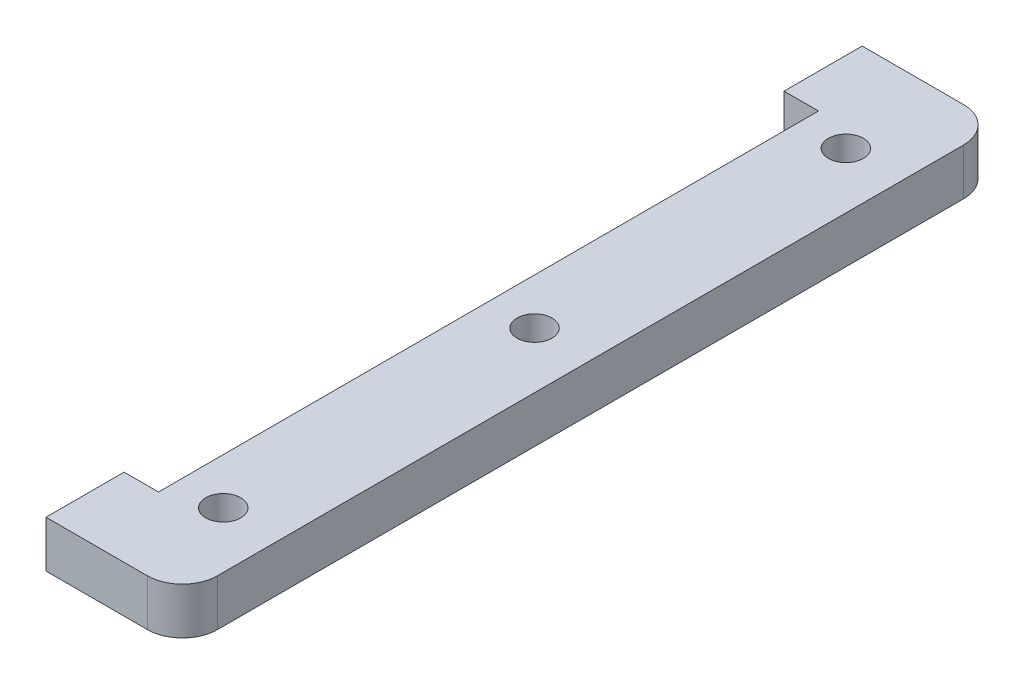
ISO-10303-21;
HEADER;
FILE_DESCRIPTION(('STEP AP214'),'2;1');
FILE_NAME('part.step','',(''),(''),'','','');
FILE_SCHEMA(('AUTOMOTIVE_DESIGN { 1 0 10303 214 1 1 1 1 }'));
ENDSEC;
DATA;
#1=APPLICATION_CONTEXT('core data for automotive mechanical design processes');
#2=APPLICATION_PROTOCOL_DEFINITION('international standard','automotive_design',2000,#1);
#3=PRODUCT_CONTEXT('',#1,'mechanical');
#4=PRODUCT('Part','Part','',(#3));
#5=PRODUCT_RELATED_PRODUCT_CATEGORY('part','',(#4));
#6=PRODUCT_DEFINITION_FORMATION('','',#4);
#7=PRODUCT_DEFINITION_CONTEXT('part definition',#1,'design');
#8=PRODUCT_DEFINITION('design','',#6,#7);
#9=PRODUCT_DEFINITION_SHAPE('','',#8);
#10=(LENGTH_UNIT() NAMED_UNIT(*) SI_UNIT(.MILLI.,.METRE.));
#11=(NAMED_UNIT(*) PLANE_ANGLE_UNIT() SI_UNIT($,.RADIAN.));
#12=(NAMED_UNIT(*) SI_UNIT($,.STERADIAN.) SOLID_ANGLE_UNIT());
#13=UNCERTAINTY_MEASURE_WITH_UNIT(LENGTH_MEASURE(1.E-05),#10,'distance_accuracy_value','');
#14=(GEOMETRIC_REPRESENTATION_CONTEXT(3) GLOBAL_UNCERTAINTY_ASSIGNED_CONTEXT((#13)) GLOBAL_UNIT_ASSIGNED_CONTEXT((#10,
#11,#12)) REPRESENTATION_CONTEXT('',''));
#15=CARTESIAN_POINT('',(0.,0.,0.));
#16=DIRECTION('',(0.,0.,1.));
#17=DIRECTION('',(1.,0.,0.));
#18=AXIS2_PLACEMENT_3D('',#15,#16,#17);
#19=CARTESIAN_POINT('',(0.,2.,0.));
#20=DIRECTION('',(0.,1.,0.));
#21=DIRECTION('',(0.,0.,1.));
#22=AXIS2_PLACEMENT_3D('',#19,#20,#21);
#23=PLANE('',#22);
#24=CARTESIAN_POINT('',(14.,2.,26.7));
#25=DIRECTION('',(0.,1.,0.));
#26=DIRECTION('',(0.,0.,1.));
#27=AXIS2_PLACEMENT_3D('',#24,#25,#26);
#28=CIRCLE('',#27,1.5);
#29=CARTESIAN_POINT('',(14.,2.,28.2));
#30=VERTEX_POINT('',#29);
#31=EDGE_CURVE('E202',#30,#30,#28,.F.);
#32=ORIENTED_EDGE('',*,*,#31,.T.);
#33=EDGE_LOOP('',(#32));
#34=FACE_BOUND('',#33,.T.);
#35=CARTESIAN_POINT('',(14.,2.,0.));
#36=DIRECTION('',(0.,1.,0.));
#37=DIRECTION('',(0.,0.,1.));
#38=AXIS2_PLACEMENT_3D('',#35,#36,#37);
#39=CIRCLE('',#38,1.5);
#40=CARTESIAN_POINT('',(14.,2.,1.5));
#41=VERTEX_POINT('',#40);
#42=EDGE_CURVE('E206',#41,#41,#39,.F.);
#43=ORIENTED_EDGE('',*,*,#42,.T.);
#44=EDGE_LOOP('',(#43));
#45=FACE_BOUND('',#44,.T.);
#46=CARTESIAN_POINT('',(14.,2.,-26.7));
#47=DIRECTION('',(0.,1.,0.));
#48=DIRECTION('',(0.,0.,1.));
#49=AXIS2_PLACEMENT_3D('',#46,#47,#48);
#50=CIRCLE('',#49,1.5);
#51=CARTESIAN_POINT('',(14.,2.,-25.2));
#52=VERTEX_POINT('',#51);
#53=EDGE_CURVE('E210',#52,#52,#50,.F.);
#54=ORIENTED_EDGE('',*,*,#53,.T.);
#55=EDGE_LOOP('',(#54));
#56=FACE_BOUND('',#55,.T.);
#57=DIRECTION('',(1.,0.,0.));
#58=VECTOR('',#57,1.);
#59=CARTESIAN_POINT('',(7.1,2.,35.));
#60=LINE('',#59,#58);
#61=CARTESIAN_POINT('',(15.8,2.,35.));
#62=VERTEX_POINT('',#61);
#63=CARTESIAN_POINT('',(7.1,2.,35.));
#64=VERTEX_POINT('',#63);
#65=EDGE_CURVE('E128',#62,#64,#60,.F.);
#66=ORIENTED_EDGE('',*,*,#65,.F.);
#67=CARTESIAN_POINT('',(15.8,2.,32.));
#68=DIRECTION('',(0.,1.,0.));
#69=DIRECTION('',(0.,0.,1.));
#70=AXIS2_PLACEMENT_3D('',#67,#68,#69);
#71=CIRCLE('',#70,3.);
#72=CARTESIAN_POINT('',(18.8,2.,32.));
#73=VERTEX_POINT('',#72);
#74=EDGE_CURVE('E20',#73,#62,#71,.F.);
#75=ORIENTED_EDGE('',*,*,#74,.F.);
#76=DIRECTION('',(0.,0.,-1.));
#77=VECTOR('',#76,1.);
#78=CARTESIAN_POINT('',(18.8,2.,32.));
#79=LINE('',#78,#77);
#80=CARTESIAN_POINT('',(18.8,2.,-32.));
#81=VERTEX_POINT('',#80);
#82=EDGE_CURVE('E113',#81,#73,#79,.F.);
#83=ORIENTED_EDGE('',*,*,#82,.F.);
#84=CARTESIAN_POINT('',(15.8,2.,-32.));
#85=DIRECTION('',(0.,1.,0.));
#86=DIRECTION('',(0.,0.,1.));
#87=AXIS2_PLACEMENT_3D('',#84,#85,#86);
#88=CIRCLE('',#87,3.);
#89=CARTESIAN_POINT('',(15.8,2.,-35.));
#90=VERTEX_POINT('',#89);
#91=EDGE_CURVE('E137',#90,#81,#88,.F.);
#92=ORIENTED_EDGE('',*,*,#91,.F.);
#93=DIRECTION('',(-1.,0.,0.));
#94=VECTOR('',#93,1.);
#95=CARTESIAN_POINT('',(15.8,2.,-35.));
#96=LINE('',#95,#94);
#97=CARTESIAN_POINT('',(7.1,2.,-35.));
#98=VERTEX_POINT('',#97);
#99=EDGE_CURVE('E182',#98,#90,#96,.F.);
#100=ORIENTED_EDGE('',*,*,#99,.F.);
#101=DIRECTION('',(0.,0.,1.));
#102=VECTOR('',#101,1.);
#103=CARTESIAN_POINT('',(7.1,2.,-35.));
#104=LINE('',#103,#102);
#105=CARTESIAN_POINT('',(7.1,2.,-28.3));
#106=VERTEX_POINT('',#105);
#107=EDGE_CURVE('E176',#106,#98,#104,.F.);
#108=ORIENTED_EDGE('',*,*,#107,.F.);
#109=DIRECTION('',(1.,0.,0.));
#110=VECTOR('',#109,1.);
#111=CARTESIAN_POINT('',(7.1,2.,-28.3));
#112=LINE('',#111,#110);
#113=CARTESIAN_POINT('',(10.05,2.,-28.3));
#114=VERTEX_POINT('',#113);
#115=EDGE_CURVE('E170',#114,#106,#112,.F.);
#116=ORIENTED_EDGE('',*,*,#115,.F.);
#117=DIRECTION('',(0.,0.,1.));
#118=VECTOR('',#117,1.);
#119=CARTESIAN_POINT('',(10.05,2.,-28.3));
#120=LINE('',#119,#118);
#121=CARTESIAN_POINT('',(10.05,2.,28.3));
#122=VERTEX_POINT('',#121);
#123=EDGE_CURVE('E164',#122,#114,#120,.F.);
#124=ORIENTED_EDGE('',*,*,#123,.F.);
#125=DIRECTION('',(-1.,0.,0.));
#126=VECTOR('',#125,1.);
#127=CARTESIAN_POINT('',(10.05,2.,28.3));
#128=LINE('',#127,#126);
#129=CARTESIAN_POINT('',(7.1,2.,28.3));
#130=VERTEX_POINT('',#129);
#131=EDGE_CURVE('E158',#130,#122,#128,.F.);
#132=ORIENTED_EDGE('',*,*,#131,.F.);
#133=DIRECTION('',(0.,0.,1.));
#134=VECTOR('',#133,1.);
#135=CARTESIAN_POINT('',(7.1,2.,28.3));
#136=LINE('',#135,#134);
#137=EDGE_CURVE('E146',#64,#130,#136,.F.);
#138=ORIENTED_EDGE('',*,*,#137,.F.);
#139=EDGE_LOOP('',(#66,#75,#83,#92,#100,#108,#116,#124,#132,#138));
#140=FACE_BOUND('',#139,.T.);
#141=ADVANCED_FACE('F17',(#34,#45,#56,#140),#23,.T.);
#142=CARTESIAN_POINT('',(15.8,-2.,32.));
#143=DIRECTION('',(0.,1.,0.));
#144=DIRECTION('',(0.,0.,1.));
#145=AXIS2_PLACEMENT_3D('',#142,#143,#144);
#146=CYLINDRICAL_SURFACE('',#145,3.);
#147=DIRECTION('',(0.,1.,0.));
#148=VECTOR('',#147,1.);
#149=CARTESIAN_POINT('',(15.8,-2.,35.));
#150=LINE('',#149,#148);
#151=CARTESIAN_POINT('',(15.8,-2.,35.));
#152=VERTEX_POINT('',#151);
#153=EDGE_CURVE('E155',#152,#62,#150,.T.);
#154=ORIENTED_EDGE('',*,*,#153,.F.);
#155=CARTESIAN_POINT('',(15.8,-2.,32.));
#156=DIRECTION('',(0.,1.,0.));
#157=DIRECTION('',(0.,0.,1.));
#158=AXIS2_PLACEMENT_3D('',#155,#156,#157);
#159=CIRCLE('',#158,3.);
#160=CARTESIAN_POINT('',(18.8,-2.,32.));
#161=VERTEX_POINT('',#160);
#162=EDGE_CURVE('E135',#152,#161,#159,.T.);
#163=ORIENTED_EDGE('',*,*,#162,.T.);
#164=DIRECTION('',(0.,1.,0.));
#165=VECTOR('',#164,1.);
#166=CARTESIAN_POINT('',(18.8,-2.,32.));
#167=LINE('',#166,#165);
#168=EDGE_CURVE('E118',#73,#161,#167,.F.);
#169=ORIENTED_EDGE('',*,*,#168,.F.);
#170=ORIENTED_EDGE('',*,*,#74,.T.);
#171=EDGE_LOOP('',(#154,#163,#169,#170));
#172=FACE_BOUND('',#171,.T.);
#173=ADVANCED_FACE('F134',(#172),#146,.T.);
#174=CARTESIAN_POINT('',(18.8,-2.,32.));
#175=DIRECTION('',(1.,0.,0.));
#176=DIRECTION('',(0.,0.,-1.));
#177=AXIS2_PLACEMENT_3D('',#174,#175,#176);
#178=PLANE('',#177);
#179=ORIENTED_EDGE('',*,*,#168,.T.);
#180=DIRECTION('',(0.,0.,1.));
#181=VECTOR('',#180,1.);
#182=CARTESIAN_POINT('',(18.8,-2.,0.));
#183=LINE('',#182,#181);
#184=CARTESIAN_POINT('',(18.8,-2.,-32.));
#185=VERTEX_POINT('',#184);
#186=EDGE_CURVE('E200',#161,#185,#183,.F.);
#187=ORIENTED_EDGE('',*,*,#186,.T.);
#188=DIRECTION('',(0.,1.,0.));
#189=VECTOR('',#188,1.);
#190=CARTESIAN_POINT('',(18.8,-2.,-32.));
#191=LINE('',#190,#189);
#192=EDGE_CURVE('E120',#81,#185,#191,.F.);
#193=ORIENTED_EDGE('',*,*,#192,.F.);
#194=ORIENTED_EDGE('',*,*,#82,.T.);
#195=EDGE_LOOP('',(#179,#187,#193,#194));
#196=FACE_BOUND('',#195,.T.);
#197=ADVANCED_FACE('F115',(#196),#178,.T.);
#198=CARTESIAN_POINT('',(15.8,-2.,-32.));
#199=DIRECTION('',(0.,1.,0.));
#200=DIRECTION('',(0.,0.,1.));
#201=AXIS2_PLACEMENT_3D('',#198,#199,#200);
#202=CYLINDRICAL_SURFACE('',#201,3.);
#203=ORIENTED_EDGE('',*,*,#192,.T.);
#204=CARTESIAN_POINT('',(15.8,-2.,-32.));
#205=DIRECTION('',(0.,1.,0.));
#206=DIRECTION('',(0.,0.,1.));
#207=AXIS2_PLACEMENT_3D('',#204,#205,#206);
#208=CIRCLE('',#207,3.);
#209=CARTESIAN_POINT('',(15.8,-2.,-35.));
#210=VERTEX_POINT('',#209);
#211=EDGE_CURVE('E195',#185,#210,#208,.T.);
#212=ORIENTED_EDGE('',*,*,#211,.T.);
#213=DIRECTION('',(0.,1.,0.));
#214=VECTOR('',#213,1.);
#215=CARTESIAN_POINT('',(15.8,-2.,-35.));
#216=LINE('',#215,#214);
#217=EDGE_CURVE('E179',#90,#210,#216,.F.);
#218=ORIENTED_EDGE('',*,*,#217,.F.);
#219=ORIENTED_EDGE('',*,*,#91,.T.);
#220=EDGE_LOOP('',(#203,#212,#218,#219));
#221=FACE_BOUND('',#220,.T.);
#222=ADVANCED_FACE('F290',(#221),#202,.T.);
#223=CARTESIAN_POINT('',(15.8,-2.,-35.));
#224=DIRECTION('',(0.,0.,-1.));
#225=DIRECTION('',(-1.,0.,0.));
#226=AXIS2_PLACEMENT_3D('',#223,#224,#225);
#227=PLANE('',#226);
#228=ORIENTED_EDGE('',*,*,#217,.T.);
#229=DIRECTION('',(1.,0.,0.));
#230=VECTOR('',#229,1.);
#231=CARTESIAN_POINT('',(0.,-2.,-35.));
#232=LINE('',#231,#230);
#233=CARTESIAN_POINT('',(7.1,-2.,-35.));
#234=VERTEX_POINT('',#233);
#235=EDGE_CURVE('E199',#210,#234,#232,.F.);
#236=ORIENTED_EDGE('',*,*,#235,.T.);
#237=DIRECTION('',(0.,1.,0.));
#238=VECTOR('',#237,1.);
#239=CARTESIAN_POINT('',(7.1,-2.,-35.));
#240=LINE('',#239,#238);
#241=EDGE_CURVE('E173',#98,#234,#240,.F.);
#242=ORIENTED_EDGE('',*,*,#241,.F.);
#243=ORIENTED_EDGE('',*,*,#99,.T.);
#244=EDGE_LOOP('',(#228,#236,#242,#243));
#245=FACE_BOUND('',#244,.T.);
#246=ADVANCED_FACE('F278',(#245),#227,.T.);
#247=CARTESIAN_POINT('',(7.1,-2.,-35.));
#248=DIRECTION('',(-1.,0.,0.));
#249=DIRECTION('',(0.,0.,1.));
#250=AXIS2_PLACEMENT_3D('',#247,#248,#249);
#251=PLANE('',#250);
#252=ORIENTED_EDGE('',*,*,#241,.T.);
#253=DIRECTION('',(0.,0.,1.));
#254=VECTOR('',#253,1.);
#255=CARTESIAN_POINT('',(7.1,-2.,0.));
#256=LINE('',#255,#254);
#257=CARTESIAN_POINT('',(7.1,-2.,-28.3));
#258=VERTEX_POINT('',#257);
#259=EDGE_CURVE('E257',#234,#258,#256,.T.);
#260=ORIENTED_EDGE('',*,*,#259,.T.);
#261=DIRECTION('',(0.,1.,0.));
#262=VECTOR('',#261,1.);
#263=CARTESIAN_POINT('',(7.1,-2.,-28.3));
#264=LINE('',#263,#262);
#265=EDGE_CURVE('E167',#106,#258,#264,.F.);
#266=ORIENTED_EDGE('',*,*,#265,.F.);
#267=ORIENTED_EDGE('',*,*,#107,.T.);
#268=EDGE_LOOP('',(#252,#260,#266,#267));
#269=FACE_BOUND('',#268,.T.);
#270=ADVANCED_FACE('F297',(#269),#251,.T.);
#271=CARTESIAN_POINT('',(7.1,-2.,-28.3));
#272=DIRECTION('',(0.,0.,1.));
#273=DIRECTION('',(1.,0.,0.));
#274=AXIS2_PLACEMENT_3D('',#271,#272,#273);
#275=PLANE('',#274);
#276=ORIENTED_EDGE('',*,*,#265,.T.);
#277=DIRECTION('',(1.,0.,0.));
#278=VECTOR('',#277,1.);
#279=CARTESIAN_POINT('',(0.,-2.,-28.3));
#280=LINE('',#279,#278);
#281=CARTESIAN_POINT('',(10.05,-2.,-28.3));
#282=VERTEX_POINT('',#281);
#283=EDGE_CURVE('E248',#258,#282,#280,.T.);
#284=ORIENTED_EDGE('',*,*,#283,.T.);
#285=DIRECTION('',(0.,1.,0.));
#286=VECTOR('',#285,1.);
#287=CARTESIAN_POINT('',(10.05,-2.,-28.3));
#288=LINE('',#287,#286);
#289=EDGE_CURVE('E161',#114,#282,#288,.F.);
#290=ORIENTED_EDGE('',*,*,#289,.F.);
#291=ORIENTED_EDGE('',*,*,#115,.T.);
#292=EDGE_LOOP('',(#276,#284,#290,#291));
#293=FACE_BOUND('',#292,.T.);
#294=ADVANCED_FACE('F299',(#293),#275,.T.);
#295=CARTESIAN_POINT('',(10.05,-2.,-28.3));
#296=DIRECTION('',(-1.,0.,0.));
#297=DIRECTION('',(0.,0.,1.));
#298=AXIS2_PLACEMENT_3D('',#295,#296,#297);
#299=PLANE('',#298);
#300=ORIENTED_EDGE('',*,*,#289,.T.);
#301=DIRECTION('',(0.,0.,1.));
#302=VECTOR('',#301,1.);
#303=CARTESIAN_POINT('',(10.05,-2.,0.));
#304=LINE('',#303,#302);
#305=CARTESIAN_POINT('',(10.05,-2.,28.3));
#306=VERTEX_POINT('',#305);
#307=EDGE_CURVE('E238',#282,#306,#304,.T.);
#308=ORIENTED_EDGE('',*,*,#307,.T.);
#309=DIRECTION('',(0.,1.,0.));
#310=VECTOR('',#309,1.);
#311=CARTESIAN_POINT('',(10.05,-2.,28.3));
#312=LINE('',#311,#310);
#313=EDGE_CURVE('E150',#122,#306,#312,.F.);
#314=ORIENTED_EDGE('',*,*,#313,.F.);
#315=ORIENTED_EDGE('',*,*,#123,.T.);
#316=EDGE_LOOP('',(#300,#308,#314,#315));
#317=FACE_BOUND('',#316,.T.);
#318=ADVANCED_FACE('F305',(#317),#299,.T.);
#319=CARTESIAN_POINT('',(10.05,-2.,28.3));
#320=DIRECTION('',(0.,0.,-1.));
#321=DIRECTION('',(-1.,0.,0.));
#322=AXIS2_PLACEMENT_3D('',#319,#320,#321);
#323=PLANE('',#322);
#324=ORIENTED_EDGE('',*,*,#313,.T.);
#325=DIRECTION('',(1.,0.,0.));
#326=VECTOR('',#325,1.);
#327=CARTESIAN_POINT('',(0.,-2.,28.3));
#328=LINE('',#327,#326);
#329=CARTESIAN_POINT('',(7.1,-2.,28.3));
#330=VERTEX_POINT('',#329);
#331=EDGE_CURVE('E228',#306,#330,#328,.F.);
#332=ORIENTED_EDGE('',*,*,#331,.T.);
#333=DIRECTION('',(0.,1.,0.));
#334=VECTOR('',#333,1.);
#335=CARTESIAN_POINT('',(7.1,-2.,28.3));
#336=LINE('',#335,#334);
#337=EDGE_CURVE('E149',#130,#330,#336,.F.);
#338=ORIENTED_EDGE('',*,*,#337,.F.);
#339=ORIENTED_EDGE('',*,*,#131,.T.);
#340=EDGE_LOOP('',(#324,#332,#338,#339));
#341=FACE_BOUND('',#340,.T.);
#342=ADVANCED_FACE('F310',(#341),#323,.T.);
#343=CARTESIAN_POINT('',(7.1,-2.,28.3));
#344=DIRECTION('',(-1.,0.,0.));
#345=DIRECTION('',(0.,0.,1.));
#346=AXIS2_PLACEMENT_3D('',#343,#344,#345);
#347=PLANE('',#346);
#348=ORIENTED_EDGE('',*,*,#337,.T.);
#349=DIRECTION('',(0.,0.,1.));
#350=VECTOR('',#349,1.);
#351=CARTESIAN_POINT('',(7.1,-2.,0.));
#352=LINE('',#351,#350);
#353=CARTESIAN_POINT('',(7.1,-2.,35.));
#354=VERTEX_POINT('',#353);
#355=EDGE_CURVE('E224',#330,#354,#352,.T.);
#356=ORIENTED_EDGE('',*,*,#355,.T.);
#357=DIRECTION('',(0.,1.,0.));
#358=VECTOR('',#357,1.);
#359=CARTESIAN_POINT('',(7.1,-2.,35.));
#360=LINE('',#359,#358);
#361=EDGE_CURVE('E40',#64,#354,#360,.F.);
#362=ORIENTED_EDGE('',*,*,#361,.F.);
#363=ORIENTED_EDGE('',*,*,#137,.T.);
#364=EDGE_LOOP('',(#348,#356,#362,#363));
#365=FACE_BOUND('',#364,.T.);
#366=ADVANCED_FACE('F312',(#365),#347,.T.);
#367=CARTESIAN_POINT('',(7.1,-2.,35.));
#368=DIRECTION('',(0.,0.,1.));
#369=DIRECTION('',(1.,0.,0.));
#370=AXIS2_PLACEMENT_3D('',#367,#368,#369);
#371=PLANE('',#370);
#372=ORIENTED_EDGE('',*,*,#361,.T.);
#373=DIRECTION('',(1.,0.,0.));
#374=VECTOR('',#373,1.);
#375=CARTESIAN_POINT('',(0.,-2.,35.));
#376=LINE('',#375,#374);
#377=EDGE_CURVE('E194',#354,#152,#376,.T.);
#378=ORIENTED_EDGE('',*,*,#377,.T.);
#379=ORIENTED_EDGE('',*,*,#153,.T.);
#380=ORIENTED_EDGE('',*,*,#65,.T.);
#381=EDGE_LOOP('',(#372,#378,#379,#380));
#382=FACE_BOUND('',#381,.T.);
#383=ADVANCED_FACE('F319',(#382),#371,.T.);
#384=CARTESIAN_POINT('',(14.,-2.,-26.7));
#385=DIRECTION('',(0.,1.,0.));
#386=DIRECTION('',(0.,0.,1.));
#387=AXIS2_PLACEMENT_3D('',#384,#385,#386);
#388=CYLINDRICAL_SURFACE('',#387,1.5);
#389=ORIENTED_EDGE('',*,*,#53,.F.);
#390=EDGE_LOOP('',(#389));
#391=FACE_BOUND('',#390,.T.);
#392=CARTESIAN_POINT('',(14.,-2.,-26.7));
#393=DIRECTION('',(0.,1.,0.));
#394=DIRECTION('',(0.,0.,1.));
#395=AXIS2_PLACEMENT_3D('',#392,#393,#394);
#396=CIRCLE('',#395,1.5);
#397=CARTESIAN_POINT('',(14.,-2.,-25.2));
#398=VERTEX_POINT('',#397);
#399=EDGE_CURVE('E190',#398,#398,#396,.F.);
#400=ORIENTED_EDGE('',*,*,#399,.T.);
#401=EDGE_LOOP('',(#400));
#402=FACE_BOUND('',#401,.T.);
#403=ADVANCED_FACE('F323',(#391,#402),#388,.F.);
#404=CARTESIAN_POINT('',(14.,-2.,0.));
#405=DIRECTION('',(0.,1.,0.));
#406=DIRECTION('',(0.,0.,1.));
#407=AXIS2_PLACEMENT_3D('',#404,#405,#406);
#408=CYLINDRICAL_SURFACE('',#407,1.5);
#409=ORIENTED_EDGE('',*,*,#42,.F.);
#410=EDGE_LOOP('',(#409));
#411=FACE_BOUND('',#410,.T.);
#412=CARTESIAN_POINT('',(14.,-2.,0.));
#413=DIRECTION('',(0.,1.,0.));
#414=DIRECTION('',(0.,0.,1.));
#415=AXIS2_PLACEMENT_3D('',#412,#413,#414);
#416=CIRCLE('',#415,1.5);
#417=CARTESIAN_POINT('',(14.,-2.,1.5));
#418=VERTEX_POINT('',#417);
#419=EDGE_CURVE('E27',#418,#418,#416,.F.);
#420=ORIENTED_EDGE('',*,*,#419,.T.);
#421=EDGE_LOOP('',(#420));
#422=FACE_BOUND('',#421,.T.);
#423=ADVANCED_FACE('F330',(#411,#422),#408,.F.);
#424=CARTESIAN_POINT('',(14.,-2.,26.7));
#425=DIRECTION('',(0.,1.,0.));
#426=DIRECTION('',(0.,0.,1.));
#427=AXIS2_PLACEMENT_3D('',#424,#425,#426);
#428=CYLINDRICAL_SURFACE('',#427,1.5);
#429=ORIENTED_EDGE('',*,*,#31,.F.);
#430=EDGE_LOOP('',(#429));
#431=FACE_BOUND('',#430,.T.);
#432=CARTESIAN_POINT('',(14.,-2.,26.7));
#433=DIRECTION('',(0.,1.,0.));
#434=DIRECTION('',(0.,0.,1.));
#435=AXIS2_PLACEMENT_3D('',#432,#433,#434);
#436=CIRCLE('',#435,1.5);
#437=CARTESIAN_POINT('',(14.,-2.,28.2));
#438=VERTEX_POINT('',#437);
#439=EDGE_CURVE('E11',#438,#438,#436,.F.);
#440=ORIENTED_EDGE('',*,*,#439,.T.);
#441=EDGE_LOOP('',(#440));
#442=FACE_BOUND('',#441,.T.);
#443=ADVANCED_FACE('F335',(#431,#442),#428,.F.);
#444=CARTESIAN_POINT('',(0.,-2.,0.));
#445=DIRECTION('',(0.,1.,0.));
#446=DIRECTION('',(0.,0.,1.));
#447=AXIS2_PLACEMENT_3D('',#444,#445,#446);
#448=PLANE('',#447);
#449=ORIENTED_EDGE('',*,*,#439,.F.);
#450=EDGE_LOOP('',(#449));
#451=FACE_BOUND('',#450,.T.);
#452=ORIENTED_EDGE('',*,*,#419,.F.);
#453=EDGE_LOOP('',(#452));
#454=FACE_BOUND('',#453,.T.);
#455=ORIENTED_EDGE('',*,*,#399,.F.);
#456=EDGE_LOOP('',(#455));
#457=FACE_BOUND('',#456,.T.);
#458=ORIENTED_EDGE('',*,*,#355,.F.);
#459=ORIENTED_EDGE('',*,*,#331,.F.);
#460=ORIENTED_EDGE('',*,*,#307,.F.);
#461=ORIENTED_EDGE('',*,*,#283,.F.);
#462=ORIENTED_EDGE('',*,*,#259,.F.);
#463=ORIENTED_EDGE('',*,*,#235,.F.);
#464=ORIENTED_EDGE('',*,*,#211,.F.);
#465=ORIENTED_EDGE('',*,*,#186,.F.);
#466=ORIENTED_EDGE('',*,*,#162,.F.);
#467=ORIENTED_EDGE('',*,*,#377,.F.);
#468=EDGE_LOOP('',(#458,#459,#460,#461,#462,#463,#464,#465,#466,#467));
#469=FACE_BOUND('',#468,.T.);
#470=ADVANCED_FACE('F286',(#451,#454,#457,#469),#448,.F.);
#471=CLOSED_SHELL('',(#141,#173,#197,#222,#246,#270,#294,#318,#342,#366,#383,#403,#423,#443,#470));
#472=MANIFOLD_SOLID_BREP('B1',#471);
#473=ADVANCED_BREP_SHAPE_REPRESENTATION('',(#18,#472),#14);
#474=SHAPE_DEFINITION_REPRESENTATION(#9,#473);
ENDSEC;
END-ISO-10303-21;
